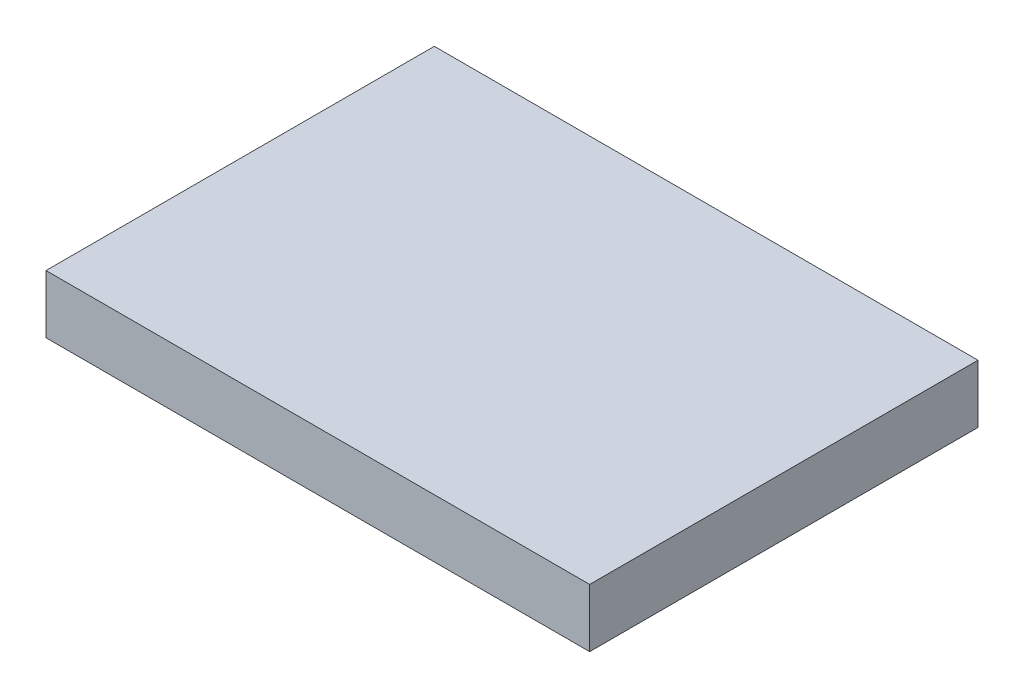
ISO-10303-21;
HEADER;
FILE_DESCRIPTION(('STEP AP214'),'2;1');
FILE_NAME('part.step','',(''),(''),'','','');
FILE_SCHEMA(('AUTOMOTIVE_DESIGN { 1 0 10303 214 1 1 1 1 }'));
ENDSEC;
DATA;
#1=APPLICATION_CONTEXT('core data for automotive mechanical design processes');
#2=APPLICATION_PROTOCOL_DEFINITION('international standard','automotive_design',2000,#1);
#3=PRODUCT_CONTEXT('',#1,'mechanical');
#4=PRODUCT('Part','Part','',(#3));
#5=PRODUCT_RELATED_PRODUCT_CATEGORY('part','',(#4));
#6=PRODUCT_DEFINITION_FORMATION('','',#4);
#7=PRODUCT_DEFINITION_CONTEXT('part definition',#1,'design');
#8=PRODUCT_DEFINITION('design','',#6,#7);
#9=PRODUCT_DEFINITION_SHAPE('','',#8);
#10=(LENGTH_UNIT() NAMED_UNIT(*) SI_UNIT(.MILLI.,.METRE.));
#11=(NAMED_UNIT(*) PLANE_ANGLE_UNIT() SI_UNIT($,.RADIAN.));
#12=(NAMED_UNIT(*) SI_UNIT($,.STERADIAN.) SOLID_ANGLE_UNIT());
#13=UNCERTAINTY_MEASURE_WITH_UNIT(LENGTH_MEASURE(1.E-05),#10,'distance_accuracy_value','');
#14=(GEOMETRIC_REPRESENTATION_CONTEXT(3) GLOBAL_UNCERTAINTY_ASSIGNED_CONTEXT((#13)) GLOBAL_UNIT_ASSIGNED_CONTEXT((#10,
#11,#12)) REPRESENTATION_CONTEXT('',''));
#15=CARTESIAN_POINT('',(0.,0.,0.));
#16=DIRECTION('',(0.,0.,1.));
#17=DIRECTION('',(1.,0.,0.));
#18=AXIS2_PLACEMENT_3D('',#15,#16,#17);
#19=CARTESIAN_POINT('',(22.225,-4.7625,-15.875));
#20=DIRECTION('',(1.,0.,0.));
#21=DIRECTION('',(0.,0.,-1.));
#22=AXIS2_PLACEMENT_3D('',#19,#20,#21);
#23=PLANE('',#22);
#24=DIRECTION('',(0.,0.,-1.));
#25=VECTOR('',#24,1.);
#26=CARTESIAN_POINT('',(22.225,0.,-15.875));
#27=LINE('',#26,#25);
#28=CARTESIAN_POINT('',(22.225,0.,15.875));
#29=VERTEX_POINT('',#28);
#30=CARTESIAN_POINT('',(22.225,0.,-15.875));
#31=VERTEX_POINT('',#30);
#32=EDGE_CURVE('E98',#29,#31,#27,.T.);
#33=ORIENTED_EDGE('',*,*,#32,.F.);
#34=DIRECTION('',(0.,1.,0.));
#35=VECTOR('',#34,1.);
#36=CARTESIAN_POINT('',(22.225,-4.7625,15.875));
#37=LINE('',#36,#35);
#38=CARTESIAN_POINT('',(22.225,-4.7625,15.875));
#39=VERTEX_POINT('',#38);
#40=EDGE_CURVE('E11',#39,#29,#37,.T.);
#41=ORIENTED_EDGE('',*,*,#40,.F.);
#42=DIRECTION('',(0.,0.,-1.));
#43=VECTOR('',#42,1.);
#44=CARTESIAN_POINT('',(22.225,-4.7625,-15.875));
#45=LINE('',#44,#43);
#46=CARTESIAN_POINT('',(22.225,-4.7625,-15.875));
#47=VERTEX_POINT('',#46);
#48=EDGE_CURVE('E92',#39,#47,#45,.T.);
#49=ORIENTED_EDGE('',*,*,#48,.T.);
#50=DIRECTION('',(0.,1.,0.));
#51=VECTOR('',#50,1.);
#52=CARTESIAN_POINT('',(22.225,-4.7625,-15.875));
#53=LINE('',#52,#51);
#54=EDGE_CURVE('E37',#47,#31,#53,.T.);
#55=ORIENTED_EDGE('',*,*,#54,.T.);
#56=EDGE_LOOP('',(#33,#41,#49,#55));
#57=FACE_BOUND('',#56,.T.);
#58=ADVANCED_FACE('F34',(#57),#23,.T.);
#59=CARTESIAN_POINT('',(-22.225,-4.7625,15.875));
#60=DIRECTION('',(0.,0.,1.));
#61=DIRECTION('',(1.,0.,0.));
#62=AXIS2_PLACEMENT_3D('',#59,#60,#61);
#63=PLANE('',#62);
#64=DIRECTION('',(1.,0.,0.));
#65=VECTOR('',#64,1.);
#66=CARTESIAN_POINT('',(-22.225,0.,15.875));
#67=LINE('',#66,#65);
#68=CARTESIAN_POINT('',(-22.225,0.,15.875));
#69=VERTEX_POINT('',#68);
#70=EDGE_CURVE('E94',#69,#29,#67,.T.);
#71=ORIENTED_EDGE('',*,*,#70,.F.);
#72=DIRECTION('',(0.,1.,0.));
#73=VECTOR('',#72,1.);
#74=CARTESIAN_POINT('',(-22.225,-4.7625,15.875));
#75=LINE('',#74,#73);
#76=CARTESIAN_POINT('',(-22.225,-4.7625,15.875));
#77=VERTEX_POINT('',#76);
#78=EDGE_CURVE('E43',#77,#69,#75,.T.);
#79=ORIENTED_EDGE('',*,*,#78,.F.);
#80=DIRECTION('',(1.,0.,0.));
#81=VECTOR('',#80,1.);
#82=CARTESIAN_POINT('',(-22.225,-4.7625,15.875));
#83=LINE('',#82,#81);
#84=EDGE_CURVE('E89',#77,#39,#83,.T.);
#85=ORIENTED_EDGE('',*,*,#84,.T.);
#86=ORIENTED_EDGE('',*,*,#40,.T.);
#87=EDGE_LOOP('',(#71,#79,#85,#86));
#88=FACE_BOUND('',#87,.T.);
#89=ADVANCED_FACE('F108',(#88),#63,.T.);
#90=CARTESIAN_POINT('',(-22.225,-4.7625,-15.875));
#91=DIRECTION('',(-1.,0.,0.));
#92=DIRECTION('',(0.,0.,1.));
#93=AXIS2_PLACEMENT_3D('',#90,#91,#92);
#94=PLANE('',#93);
#95=DIRECTION('',(0.,0.,1.));
#96=VECTOR('',#95,1.);
#97=CARTESIAN_POINT('',(-22.225,0.,-15.875));
#98=LINE('',#97,#96);
#99=CARTESIAN_POINT('',(-22.225,0.,-15.875));
#100=VERTEX_POINT('',#99);
#101=EDGE_CURVE('E84',#100,#69,#98,.T.);
#102=ORIENTED_EDGE('',*,*,#101,.F.);
#103=DIRECTION('',(0.,1.,0.));
#104=VECTOR('',#103,1.);
#105=CARTESIAN_POINT('',(-22.225,-4.7625,-15.875));
#106=LINE('',#105,#104);
#107=CARTESIAN_POINT('',(-22.225,-4.7625,-15.875));
#108=VERTEX_POINT('',#107);
#109=EDGE_CURVE('E79',#108,#100,#106,.T.);
#110=ORIENTED_EDGE('',*,*,#109,.F.);
#111=DIRECTION('',(0.,0.,1.));
#112=VECTOR('',#111,1.);
#113=CARTESIAN_POINT('',(-22.225,-4.7625,-15.875));
#114=LINE('',#113,#112);
#115=EDGE_CURVE('E82',#108,#77,#114,.T.);
#116=ORIENTED_EDGE('',*,*,#115,.T.);
#117=ORIENTED_EDGE('',*,*,#78,.T.);
#118=EDGE_LOOP('',(#102,#110,#116,#117));
#119=FACE_BOUND('',#118,.T.);
#120=ADVANCED_FACE('F81',(#119),#94,.T.);
#121=CARTESIAN_POINT('',(-22.225,-4.7625,-15.875));
#122=DIRECTION('',(0.,0.,-1.));
#123=DIRECTION('',(-1.,0.,0.));
#124=AXIS2_PLACEMENT_3D('',#121,#122,#123);
#125=PLANE('',#124);
#126=DIRECTION('',(-1.,0.,0.));
#127=VECTOR('',#126,1.);
#128=CARTESIAN_POINT('',(-22.225,0.,-15.875));
#129=LINE('',#128,#127);
#130=EDGE_CURVE('E101',#31,#100,#129,.T.);
#131=ORIENTED_EDGE('',*,*,#130,.F.);
#132=ORIENTED_EDGE('',*,*,#54,.F.);
#133=DIRECTION('',(-1.,0.,0.));
#134=VECTOR('',#133,1.);
#135=CARTESIAN_POINT('',(-22.225,-4.7625,-15.875));
#136=LINE('',#135,#134);
#137=EDGE_CURVE('E88',#47,#108,#136,.T.);
#138=ORIENTED_EDGE('',*,*,#137,.T.);
#139=ORIENTED_EDGE('',*,*,#109,.T.);
#140=EDGE_LOOP('',(#131,#132,#138,#139));
#141=FACE_BOUND('',#140,.T.);
#142=ADVANCED_FACE('F91',(#141),#125,.T.);
#143=CARTESIAN_POINT('',(22.225,-4.7625,15.875));
#144=DIRECTION('',(0.,1.,0.));
#145=DIRECTION('',(0.,0.,1.));
#146=AXIS2_PLACEMENT_3D('',#143,#144,#145);
#147=PLANE('',#146);
#148=ORIENTED_EDGE('',*,*,#48,.F.);
#149=ORIENTED_EDGE('',*,*,#84,.F.);
#150=ORIENTED_EDGE('',*,*,#115,.F.);
#151=ORIENTED_EDGE('',*,*,#137,.F.);
#152=EDGE_LOOP('',(#148,#149,#150,#151));
#153=FACE_BOUND('',#152,.T.);
#154=ADVANCED_FACE('F87',(#153),#147,.F.);
#155=CARTESIAN_POINT('',(22.225,0.,15.875));
#156=DIRECTION('',(0.,1.,0.));
#157=DIRECTION('',(0.,0.,1.));
#158=AXIS2_PLACEMENT_3D('',#155,#156,#157);
#159=PLANE('',#158);
#160=ORIENTED_EDGE('',*,*,#32,.T.);
#161=ORIENTED_EDGE('',*,*,#130,.T.);
#162=ORIENTED_EDGE('',*,*,#101,.T.);
#163=ORIENTED_EDGE('',*,*,#70,.T.);
#164=EDGE_LOOP('',(#160,#161,#162,#163));
#165=FACE_BOUND('',#164,.T.);
#166=ADVANCED_FACE('F107',(#165),#159,.T.);
#167=CLOSED_SHELL('',(#58,#89,#120,#142,#154,#166));
#168=MANIFOLD_SOLID_BREP('B2',#167);
#169=ADVANCED_BREP_SHAPE_REPRESENTATION('',(#18,#168),#14);
#170=SHAPE_DEFINITION_REPRESENTATION(#9,#169);
ENDSEC;
END-ISO-10303-21;
